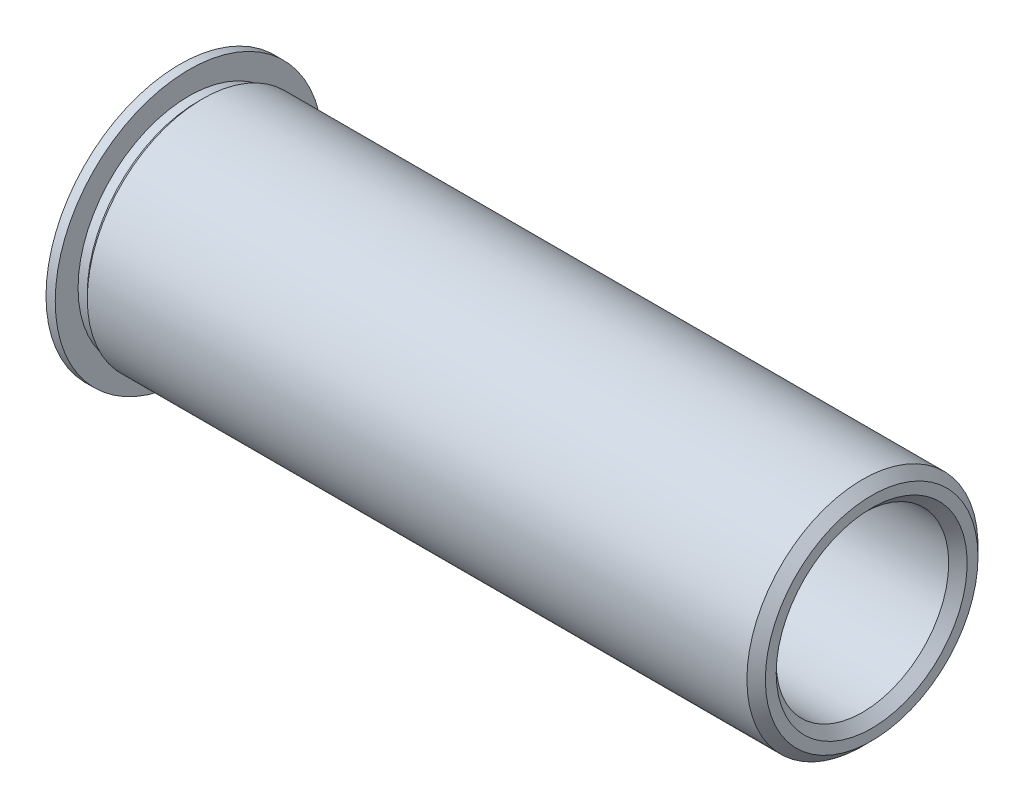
ISO-10303-21;
HEADER;
FILE_DESCRIPTION(('STEP AP214'),'2;1');
FILE_NAME('part.step','',(''),(''),'','','');
FILE_SCHEMA(('AUTOMOTIVE_DESIGN { 1 0 10303 214 1 1 1 1 }'));
ENDSEC;
DATA;
#1=APPLICATION_CONTEXT('core data for automotive mechanical design processes');
#2=APPLICATION_PROTOCOL_DEFINITION('international standard','automotive_design',2000,#1);
#3=PRODUCT_CONTEXT('',#1,'mechanical');
#4=PRODUCT('Part','Part','',(#3));
#5=PRODUCT_RELATED_PRODUCT_CATEGORY('part','',(#4));
#6=PRODUCT_DEFINITION_FORMATION('','',#4);
#7=PRODUCT_DEFINITION_CONTEXT('part definition',#1,'design');
#8=PRODUCT_DEFINITION('design','',#6,#7);
#9=PRODUCT_DEFINITION_SHAPE('','',#8);
#10=(LENGTH_UNIT() NAMED_UNIT(*) SI_UNIT(.MILLI.,.METRE.));
#11=(NAMED_UNIT(*) PLANE_ANGLE_UNIT() SI_UNIT($,.RADIAN.));
#12=(NAMED_UNIT(*) SI_UNIT($,.STERADIAN.) SOLID_ANGLE_UNIT());
#13=UNCERTAINTY_MEASURE_WITH_UNIT(LENGTH_MEASURE(1.E-05),#10,'distance_accuracy_value','');
#14=(GEOMETRIC_REPRESENTATION_CONTEXT(3) GLOBAL_UNCERTAINTY_ASSIGNED_CONTEXT((#13)) GLOBAL_UNIT_ASSIGNED_CONTEXT((#10,
#11,#12)) REPRESENTATION_CONTEXT('',''));
#15=CARTESIAN_POINT('',(0.,0.,0.));
#16=DIRECTION('',(0.,0.,1.));
#17=DIRECTION('',(1.,0.,0.));
#18=AXIS2_PLACEMENT_3D('',#15,#16,#17);
#19=CARTESIAN_POINT('',(-45.0910828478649,95.4400873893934,0.));
#20=DIRECTION('',(-1.,0.,0.));
#21=DIRECTION('',(0.,0.,1.));
#22=AXIS2_PLACEMENT_3D('',#19,#20,#21);
#23=PLANE('',#22);
#24=CARTESIAN_POINT('',(-45.0910828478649,95.4400873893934,0.));
#25=DIRECTION('',(-1.,0.,0.));
#26=DIRECTION('',(0.,0.,1.));
#27=AXIS2_PLACEMENT_3D('',#24,#25,#26);
#28=CIRCLE('',#27,2.6289);
#29=CARTESIAN_POINT('',(-45.0910828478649,95.4400873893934,2.6289));
#30=VERTEX_POINT('',#29);
#31=EDGE_CURVE('E10',#30,#30,#28,.T.);
#32=ORIENTED_EDGE('',*,*,#31,.T.);
#33=EDGE_LOOP('',(#32));
#34=FACE_BOUND('',#33,.T.);
#35=CARTESIAN_POINT('',(-45.0910828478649,95.4400873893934,0.));
#36=DIRECTION('',(-1.,0.,0.));
#37=DIRECTION('',(0.,0.,1.));
#38=AXIS2_PLACEMENT_3D('',#35,#36,#37);
#39=CIRCLE('',#38,2.92735);
#40=CARTESIAN_POINT('',(-45.0910828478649,95.4400873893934,2.92735));
#41=VERTEX_POINT('',#40);
#42=EDGE_CURVE('E52',#41,#41,#39,.T.);
#43=ORIENTED_EDGE('',*,*,#42,.F.);
#44=EDGE_LOOP('',(#43));
#45=FACE_BOUND('',#44,.T.);
#46=ADVANCED_FACE('F32',(#34,#45),#23,.F.);
#47=CARTESIAN_POINT('',(-45.0910828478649,95.4400873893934,0.));
#48=DIRECTION('',(-1.,0.,0.));
#49=DIRECTION('',(0.,0.,1.));
#50=AXIS2_PLACEMENT_3D('',#47,#48,#49);
#51=CONICAL_SURFACE('',#50,2.92735,0.785398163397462);
#52=CARTESIAN_POINT('',(-45.3450828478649,95.4400873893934,0.));
#53=DIRECTION('',(-1.,0.,0.));
#54=DIRECTION('',(0.,0.,1.));
#55=AXIS2_PLACEMENT_3D('',#52,#53,#54);
#56=CIRCLE('',#55,3.18135);
#57=CARTESIAN_POINT('',(-45.3450828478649,95.4400873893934,3.18135));
#58=VERTEX_POINT('',#57);
#59=EDGE_CURVE('E55',#58,#58,#56,.T.);
#60=ORIENTED_EDGE('',*,*,#59,.F.);
#61=EDGE_LOOP('',(#60));
#62=FACE_BOUND('',#61,.T.);
#63=ORIENTED_EDGE('',*,*,#42,.T.);
#64=EDGE_LOOP('',(#63));
#65=FACE_BOUND('',#64,.T.);
#66=ADVANCED_FACE('F103',(#62,#65),#51,.T.);
#67=CARTESIAN_POINT('',(-64.141082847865,95.4400873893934,0.));
#68=DIRECTION('',(-1.,0.,0.));
#69=DIRECTION('',(0.,0.,1.));
#70=AXIS2_PLACEMENT_3D('',#67,#68,#69);
#71=CYLINDRICAL_SURFACE('',#70,3.18135);
#72=CARTESIAN_POINT('',(-63.5060828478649,95.4400873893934,0.));
#73=DIRECTION('',(-1.,0.,0.));
#74=DIRECTION('',(0.,0.,1.));
#75=AXIS2_PLACEMENT_3D('',#72,#73,#74);
#76=CIRCLE('',#75,3.18135);
#77=CARTESIAN_POINT('',(-63.5060828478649,95.4400873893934,3.18135));
#78=VERTEX_POINT('',#77);
#79=EDGE_CURVE('E58',#78,#78,#76,.T.);
#80=ORIENTED_EDGE('',*,*,#79,.F.);
#81=EDGE_LOOP('',(#80));
#82=FACE_BOUND('',#81,.T.);
#83=ORIENTED_EDGE('',*,*,#59,.T.);
#84=EDGE_LOOP('',(#83));
#85=FACE_BOUND('',#84,.T.);
#86=ADVANCED_FACE('F97',(#82,#85),#71,.T.);
#87=CARTESIAN_POINT('',(-63.5060828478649,95.4400873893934,0.));
#88=DIRECTION('',(1.,0.,0.));
#89=DIRECTION('',(0.,0.,-1.));
#90=AXIS2_PLACEMENT_3D('',#87,#88,#89);
#91=CONICAL_SURFACE('',#90,3.18135,0.785398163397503);
#92=CARTESIAN_POINT('',(-63.6330828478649,95.4400873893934,0.));
#93=DIRECTION('',(-1.,0.,0.));
#94=DIRECTION('',(0.,0.,1.));
#95=AXIS2_PLACEMENT_3D('',#92,#93,#94);
#96=CIRCLE('',#95,3.05435);
#97=CARTESIAN_POINT('',(-63.6330828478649,95.4400873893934,3.05435));
#98=VERTEX_POINT('',#97);
#99=EDGE_CURVE('E61',#98,#98,#96,.T.);
#100=ORIENTED_EDGE('',*,*,#99,.F.);
#101=EDGE_LOOP('',(#100));
#102=FACE_BOUND('',#101,.T.);
#103=ORIENTED_EDGE('',*,*,#79,.T.);
#104=EDGE_LOOP('',(#103));
#105=FACE_BOUND('',#104,.T.);
#106=ADVANCED_FACE('F91',(#102,#105),#91,.T.);
#107=CARTESIAN_POINT('',(-64.141082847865,95.4400873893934,0.));
#108=DIRECTION('',(-1.,0.,0.));
#109=DIRECTION('',(0.,0.,1.));
#110=AXIS2_PLACEMENT_3D('',#107,#108,#109);
#111=CYLINDRICAL_SURFACE('',#110,3.05435);
#112=CARTESIAN_POINT('',(-63.8870828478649,95.4400873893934,0.));
#113=DIRECTION('',(-1.,0.,0.));
#114=DIRECTION('',(0.,0.,1.));
#115=AXIS2_PLACEMENT_3D('',#112,#113,#114);
#116=CIRCLE('',#115,3.05435);
#117=CARTESIAN_POINT('',(-63.8870828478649,95.4400873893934,3.05435));
#118=VERTEX_POINT('',#117);
#119=EDGE_CURVE('E64',#118,#118,#116,.T.);
#120=ORIENTED_EDGE('',*,*,#119,.F.);
#121=EDGE_LOOP('',(#120));
#122=FACE_BOUND('',#121,.T.);
#123=ORIENTED_EDGE('',*,*,#99,.T.);
#124=EDGE_LOOP('',(#123));
#125=FACE_BOUND('',#124,.T.);
#126=ADVANCED_FACE('F85',(#122,#125),#111,.T.);
#127=CARTESIAN_POINT('',(-63.8870828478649,98.4944373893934,0.));
#128=DIRECTION('',(-1.,0.,0.));
#129=DIRECTION('',(0.,0.,1.));
#130=AXIS2_PLACEMENT_3D('',#127,#128,#129);
#131=PLANE('',#130);
#132=CARTESIAN_POINT('',(-63.8870828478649,95.4400873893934,0.));
#133=DIRECTION('',(-1.,0.,0.));
#134=DIRECTION('',(0.,0.,1.));
#135=AXIS2_PLACEMENT_3D('',#132,#133,#134);
#136=CIRCLE('',#135,3.68299999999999);
#137=CARTESIAN_POINT('',(-63.8870828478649,95.4400873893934,3.68299999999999));
#138=VERTEX_POINT('',#137);
#139=EDGE_CURVE('E67',#138,#138,#136,.T.);
#140=ORIENTED_EDGE('',*,*,#139,.F.);
#141=EDGE_LOOP('',(#140));
#142=FACE_BOUND('',#141,.T.);
#143=ORIENTED_EDGE('',*,*,#119,.T.);
#144=EDGE_LOOP('',(#143));
#145=FACE_BOUND('',#144,.T.);
#146=ADVANCED_FACE('F79',(#142,#145),#131,.F.);
#147=CARTESIAN_POINT('',(-64.141082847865,95.4400873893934,0.));
#148=DIRECTION('',(-1.,0.,0.));
#149=DIRECTION('',(0.,0.,1.));
#150=AXIS2_PLACEMENT_3D('',#147,#148,#149);
#151=CYLINDRICAL_SURFACE('',#150,3.683);
#152=CARTESIAN_POINT('',(-64.141082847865,95.4400873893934,0.));
#153=DIRECTION('',(-1.,0.,0.));
#154=DIRECTION('',(0.,0.,1.));
#155=AXIS2_PLACEMENT_3D('',#152,#153,#154);
#156=CIRCLE('',#155,3.68300000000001);
#157=CARTESIAN_POINT('',(-64.141082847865,95.4400873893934,3.68300000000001));
#158=VERTEX_POINT('',#157);
#159=EDGE_CURVE('E70',#158,#158,#156,.T.);
#160=ORIENTED_EDGE('',*,*,#159,.F.);
#161=EDGE_LOOP('',(#160));
#162=FACE_BOUND('',#161,.T.);
#163=ORIENTED_EDGE('',*,*,#139,.T.);
#164=EDGE_LOOP('',(#163));
#165=FACE_BOUND('',#164,.T.);
#166=ADVANCED_FACE('F76',(#162,#165),#151,.T.);
#167=CARTESIAN_POINT('',(-64.141082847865,95.4400873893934,0.));
#168=DIRECTION('',(1.,0.,0.));
#169=DIRECTION('',(0.,0.,-1.));
#170=AXIS2_PLACEMENT_3D('',#167,#168,#169);
#171=PLANE('',#170);
#172=CARTESIAN_POINT('',(-64.141082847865,95.4400873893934,0.));
#173=DIRECTION('',(1.,0.,0.));
#174=DIRECTION('',(0.,0.,-1.));
#175=AXIS2_PLACEMENT_3D('',#172,#173,#174);
#176=CIRCLE('',#175,2.6289);
#177=CARTESIAN_POINT('',(-64.141082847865,95.4400873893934,-2.6289));
#178=VERTEX_POINT('',#177);
#179=EDGE_CURVE('E47',#178,#178,#176,.T.);
#180=ORIENTED_EDGE('',*,*,#179,.T.);
#181=EDGE_LOOP('',(#180));
#182=FACE_BOUND('',#181,.T.);
#183=ORIENTED_EDGE('',*,*,#159,.T.);
#184=EDGE_LOOP('',(#183));
#185=FACE_BOUND('',#184,.T.);
#186=ADVANCED_FACE('F74',(#182,#185),#171,.F.);
#187=CARTESIAN_POINT('',(-64.141082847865,95.4400873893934,0.));
#188=DIRECTION('',(1.,0.,0.));
#189=DIRECTION('',(0.,0.,-1.));
#190=AXIS2_PLACEMENT_3D('',#187,#188,#189);
#191=CYLINDRICAL_SURFACE('',#190,2.3749);
#192=CARTESIAN_POINT('',(-45.3450828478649,95.4400873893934,0.));
#193=DIRECTION('',(-1.,0.,0.));
#194=DIRECTION('',(0.,0.,1.));
#195=AXIS2_PLACEMENT_3D('',#192,#193,#194);
#196=CIRCLE('',#195,2.3749);
#197=CARTESIAN_POINT('',(-45.3450828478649,95.4400873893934,2.3749));
#198=VERTEX_POINT('',#197);
#199=EDGE_CURVE('E39',#198,#198,#196,.F.);
#200=ORIENTED_EDGE('',*,*,#199,.T.);
#201=EDGE_LOOP('',(#200));
#202=FACE_BOUND('',#201,.T.);
#203=CARTESIAN_POINT('',(-63.8870828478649,95.4400873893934,0.));
#204=DIRECTION('',(1.,0.,0.));
#205=DIRECTION('',(0.,0.,-1.));
#206=AXIS2_PLACEMENT_3D('',#203,#204,#205);
#207=CIRCLE('',#206,2.3749);
#208=CARTESIAN_POINT('',(-63.8870828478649,95.4400873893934,-2.3749));
#209=VERTEX_POINT('',#208);
#210=EDGE_CURVE('E43',#209,#209,#207,.F.);
#211=ORIENTED_EDGE('',*,*,#210,.T.);
#212=EDGE_LOOP('',(#211));
#213=FACE_BOUND('',#212,.T.);
#214=ADVANCED_FACE('F118',(#202,#213),#191,.F.);
#215=CARTESIAN_POINT('',(-64.141082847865,95.4400873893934,0.));
#216=DIRECTION('',(-1.,0.,0.));
#217=DIRECTION('',(0.,0.,1.));
#218=AXIS2_PLACEMENT_3D('',#215,#216,#217);
#219=CONICAL_SURFACE('',#218,2.6289,0.785398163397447);
#220=ORIENTED_EDGE('',*,*,#210,.F.);
#221=EDGE_LOOP('',(#220));
#222=FACE_BOUND('',#221,.T.);
#223=ORIENTED_EDGE('',*,*,#179,.F.);
#224=EDGE_LOOP('',(#223));
#225=FACE_BOUND('',#224,.T.);
#226=ADVANCED_FACE('F116',(#222,#225),#219,.F.);
#227=CARTESIAN_POINT('',(-45.3450828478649,95.4400873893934,0.));
#228=DIRECTION('',(1.,0.,0.));
#229=DIRECTION('',(0.,0.,-1.));
#230=AXIS2_PLACEMENT_3D('',#227,#228,#229);
#231=CONICAL_SURFACE('',#230,2.3749,0.785398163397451);
#232=ORIENTED_EDGE('',*,*,#31,.F.);
#233=EDGE_LOOP('',(#232));
#234=FACE_BOUND('',#233,.T.);
#235=ORIENTED_EDGE('',*,*,#199,.F.);
#236=EDGE_LOOP('',(#235));
#237=FACE_BOUND('',#236,.T.);
#238=ADVANCED_FACE('F34',(#234,#237),#231,.F.);
#239=CLOSED_SHELL('',(#46,#66,#86,#106,#126,#146,#166,#186,#214,#226,#238));
#240=MANIFOLD_SOLID_BREP('B2',#239);
#241=ADVANCED_BREP_SHAPE_REPRESENTATION('',(#18,#240),#14);
#242=SHAPE_DEFINITION_REPRESENTATION(#9,#241);
ENDSEC;
END-ISO-10303-21;
